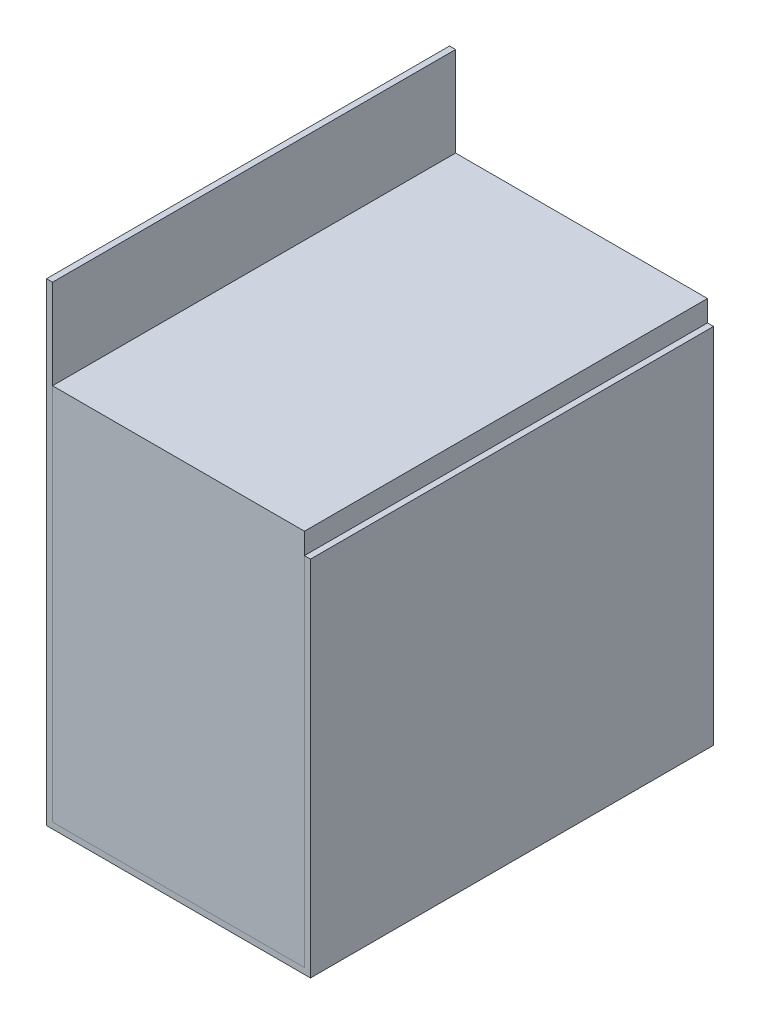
ISO-10303-21;
HEADER;
FILE_DESCRIPTION(('STEP AP214'),'2;1');
FILE_NAME('part.step','',(''),(''),'','','');
FILE_SCHEMA(('AUTOMOTIVE_DESIGN { 1 0 10303 214 1 1 1 1 }'));
ENDSEC;
DATA;
#1=APPLICATION_CONTEXT('core data for automotive mechanical design processes');
#2=APPLICATION_PROTOCOL_DEFINITION('international standard','automotive_design',2000,#1);
#3=PRODUCT_CONTEXT('',#1,'mechanical');
#4=PRODUCT('Part','Part','',(#3));
#5=PRODUCT_RELATED_PRODUCT_CATEGORY('part','',(#4));
#6=PRODUCT_DEFINITION_FORMATION('','',#4);
#7=PRODUCT_DEFINITION_CONTEXT('part definition',#1,'design');
#8=PRODUCT_DEFINITION('design','',#6,#7);
#9=PRODUCT_DEFINITION_SHAPE('','',#8);
#10=(LENGTH_UNIT() NAMED_UNIT(*) SI_UNIT(.MILLI.,.METRE.));
#11=(NAMED_UNIT(*) PLANE_ANGLE_UNIT() SI_UNIT($,.RADIAN.));
#12=(NAMED_UNIT(*) SI_UNIT($,.STERADIAN.) SOLID_ANGLE_UNIT());
#13=UNCERTAINTY_MEASURE_WITH_UNIT(LENGTH_MEASURE(1.E-05),#10,'distance_accuracy_value','');
#14=(GEOMETRIC_REPRESENTATION_CONTEXT(3) GLOBAL_UNCERTAINTY_ASSIGNED_CONTEXT((#13)) GLOBAL_UNIT_ASSIGNED_CONTEXT((#10,
#11,#12)) REPRESENTATION_CONTEXT('',''));
#15=CARTESIAN_POINT('',(0.,0.,0.));
#16=DIRECTION('',(0.,0.,1.));
#17=DIRECTION('',(1.,0.,0.));
#18=AXIS2_PLACEMENT_3D('',#15,#16,#17);
#19=CARTESIAN_POINT('',(6.00000000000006,-464.,200.));
#20=DIRECTION('',(1.,0.,0.));
#21=DIRECTION('',(0.,0.,-1.));
#22=AXIS2_PLACEMENT_3D('',#19,#20,#21);
#23=PLANE('',#22);
#24=DIRECTION('',(0.,-1.,0.));
#25=VECTOR('',#24,1.);
#26=CARTESIAN_POINT('',(6.00000000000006,-464.,-200.));
#27=LINE('',#26,#25);
#28=CARTESIAN_POINT('',(6.00000000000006,-89.,-200.));
#29=VERTEX_POINT('',#28);
#30=CARTESIAN_POINT('',(6.00000000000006,-464.,-200.));
#31=VERTEX_POINT('',#30);
#32=EDGE_CURVE('E105',#29,#31,#27,.T.);
#33=ORIENTED_EDGE('',*,*,#32,.T.);
#34=DIRECTION('',(0.,0.,-1.));
#35=VECTOR('',#34,1.);
#36=CARTESIAN_POINT('',(6.00000000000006,-464.,200.));
#37=LINE('',#36,#35);
#38=CARTESIAN_POINT('',(6.00000000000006,-464.,200.));
#39=VERTEX_POINT('',#38);
#40=EDGE_CURVE('E12',#39,#31,#37,.T.);
#41=ORIENTED_EDGE('',*,*,#40,.F.);
#42=DIRECTION('',(0.,-1.,0.));
#43=VECTOR('',#42,1.);
#44=CARTESIAN_POINT('',(6.00000000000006,-464.,200.));
#45=LINE('',#44,#43);
#46=CARTESIAN_POINT('',(6.00000000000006,-89.,200.));
#47=VERTEX_POINT('',#46);
#48=EDGE_CURVE('E93',#47,#39,#45,.T.);
#49=ORIENTED_EDGE('',*,*,#48,.F.);
#50=DIRECTION('',(0.,0.,-1.));
#51=VECTOR('',#50,1.);
#52=CARTESIAN_POINT('',(6.00000000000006,-89.,200.));
#53=LINE('',#52,#51);
#54=EDGE_CURVE('E101',#47,#29,#53,.T.);
#55=ORIENTED_EDGE('',*,*,#54,.T.);
#56=EDGE_LOOP('',(#33,#41,#49,#55));
#57=FACE_BOUND('',#56,.T.);
#58=ADVANCED_FACE('F42',(#57),#23,.F.);
#59=CARTESIAN_POINT('',(6.00000000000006,-464.,200.));
#60=DIRECTION('',(0.,1.,0.));
#61=DIRECTION('',(0.,0.,1.));
#62=AXIS2_PLACEMENT_3D('',#59,#60,#61);
#63=PLANE('',#62);
#64=DIRECTION('',(1.,0.,0.));
#65=VECTOR('',#64,1.);
#66=CARTESIAN_POINT('',(6.00000000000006,-464.,-200.));
#67=LINE('',#66,#65);
#68=CARTESIAN_POINT('',(256.,-464.,-200.));
#69=VERTEX_POINT('',#68);
#70=EDGE_CURVE('E97',#31,#69,#67,.T.);
#71=ORIENTED_EDGE('',*,*,#70,.T.);
#72=DIRECTION('',(0.,0.,-1.));
#73=VECTOR('',#72,1.);
#74=CARTESIAN_POINT('',(256.,-464.,200.));
#75=LINE('',#74,#73);
#76=CARTESIAN_POINT('',(256.,-464.,200.));
#77=VERTEX_POINT('',#76);
#78=EDGE_CURVE('E50',#77,#69,#75,.T.);
#79=ORIENTED_EDGE('',*,*,#78,.F.);
#80=DIRECTION('',(1.,0.,0.));
#81=VECTOR('',#80,1.);
#82=CARTESIAN_POINT('',(6.00000000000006,-464.,200.));
#83=LINE('',#82,#81);
#84=EDGE_CURVE('E88',#39,#77,#83,.T.);
#85=ORIENTED_EDGE('',*,*,#84,.F.);
#86=ORIENTED_EDGE('',*,*,#40,.T.);
#87=EDGE_LOOP('',(#71,#79,#85,#86));
#88=FACE_BOUND('',#87,.T.);
#89=ADVANCED_FACE('F96',(#88),#63,.F.);
#90=CARTESIAN_POINT('',(256.,-464.,200.));
#91=DIRECTION('',(-1.,0.,0.));
#92=DIRECTION('',(0.,0.,1.));
#93=AXIS2_PLACEMENT_3D('',#90,#91,#92);
#94=PLANE('',#93);
#95=DIRECTION('',(0.,1.,0.));
#96=VECTOR('',#95,1.);
#97=CARTESIAN_POINT('',(256.,-464.,-200.));
#98=LINE('',#97,#96);
#99=CARTESIAN_POINT('',(256.,-89.,-200.));
#100=VERTEX_POINT('',#99);
#101=EDGE_CURVE('E75',#69,#100,#98,.T.);
#102=ORIENTED_EDGE('',*,*,#101,.T.);
#103=DIRECTION('',(0.,0.,-1.));
#104=VECTOR('',#103,1.);
#105=CARTESIAN_POINT('',(256.,-89.,200.));
#106=LINE('',#105,#104);
#107=CARTESIAN_POINT('',(256.,-89.,200.));
#108=VERTEX_POINT('',#107);
#109=EDGE_CURVE('E98',#108,#100,#106,.T.);
#110=ORIENTED_EDGE('',*,*,#109,.F.);
#111=DIRECTION('',(0.,1.,0.));
#112=VECTOR('',#111,1.);
#113=CARTESIAN_POINT('',(256.,-464.,200.));
#114=LINE('',#113,#112);
#115=EDGE_CURVE('E91',#77,#108,#114,.T.);
#116=ORIENTED_EDGE('',*,*,#115,.F.);
#117=ORIENTED_EDGE('',*,*,#78,.T.);
#118=EDGE_LOOP('',(#102,#110,#116,#117));
#119=FACE_BOUND('',#118,.T.);
#120=ADVANCED_FACE('F99',(#119),#94,.F.);
#121=CARTESIAN_POINT('',(6.00000000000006,-89.,200.));
#122=DIRECTION('',(0.,-1.,0.));
#123=DIRECTION('',(0.,0.,-1.));
#124=AXIS2_PLACEMENT_3D('',#121,#122,#123);
#125=PLANE('',#124);
#126=DIRECTION('',(-1.,0.,0.));
#127=VECTOR('',#126,1.);
#128=CARTESIAN_POINT('',(6.00000000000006,-89.,-200.));
#129=LINE('',#128,#127);
#130=EDGE_CURVE('E81',#100,#29,#129,.T.);
#131=ORIENTED_EDGE('',*,*,#130,.T.);
#132=ORIENTED_EDGE('',*,*,#54,.F.);
#133=DIRECTION('',(-1.,0.,0.));
#134=VECTOR('',#133,1.);
#135=CARTESIAN_POINT('',(6.00000000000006,-89.,200.));
#136=LINE('',#135,#134);
#137=EDGE_CURVE('E58',#108,#47,#136,.T.);
#138=ORIENTED_EDGE('',*,*,#137,.F.);
#139=ORIENTED_EDGE('',*,*,#109,.T.);
#140=EDGE_LOOP('',(#131,#132,#138,#139));
#141=FACE_BOUND('',#140,.T.);
#142=ADVANCED_FACE('F112',(#141),#125,.F.);
#143=CARTESIAN_POINT('',(0.,0.,200.));
#144=DIRECTION('',(0.,0.,-1.));
#145=DIRECTION('',(-1.,0.,0.));
#146=AXIS2_PLACEMENT_3D('',#143,#144,#145);
#147=PLANE('',#146);
#148=ORIENTED_EDGE('',*,*,#48,.T.);
#149=ORIENTED_EDGE('',*,*,#84,.T.);
#150=ORIENTED_EDGE('',*,*,#115,.T.);
#151=ORIENTED_EDGE('',*,*,#137,.T.);
#152=EDGE_LOOP('',(#148,#149,#150,#151));
#153=FACE_BOUND('',#152,.T.);
#154=ADVANCED_FACE('F89',(#153),#147,.F.);
#155=CARTESIAN_POINT('',(0.,0.,-200.));
#156=DIRECTION('',(0.,0.,-1.));
#157=DIRECTION('',(-1.,0.,0.));
#158=AXIS2_PLACEMENT_3D('',#155,#156,#157);
#159=PLANE('',#158);
#160=ORIENTED_EDGE('',*,*,#32,.F.);
#161=ORIENTED_EDGE('',*,*,#130,.F.);
#162=ORIENTED_EDGE('',*,*,#101,.F.);
#163=ORIENTED_EDGE('',*,*,#70,.F.);
#164=EDGE_LOOP('',(#160,#161,#162,#163));
#165=FACE_BOUND('',#164,.T.);
#166=ADVANCED_FACE('F115',(#165),#159,.T.);
#167=CLOSED_SHELL('',(#58,#89,#120,#142,#154,#166));
#168=MANIFOLD_SOLID_BREP('B2',#167);
#169=CARTESIAN_POINT('',(0.,0.,200.));
#170=DIRECTION('',(1.,0.,0.));
#171=DIRECTION('',(0.,1.,0.));
#172=AXIS2_PLACEMENT_3D('',#169,#170,#171);
#173=PLANE('',#172);
#174=DIRECTION('',(0.,-1.,0.));
#175=VECTOR('',#174,1.);
#176=CARTESIAN_POINT('',(0.,0.,-200.));
#177=LINE('',#176,#175);
#178=CARTESIAN_POINT('',(0.,0.,-200.));
#179=VERTEX_POINT('',#178);
#180=CARTESIAN_POINT('',(0.,-470.,-200.));
#181=VERTEX_POINT('',#180);
#182=EDGE_CURVE('E261',#179,#181,#177,.T.);
#183=ORIENTED_EDGE('',*,*,#182,.T.);
#184=DIRECTION('',(0.,0.,-1.));
#185=VECTOR('',#184,1.);
#186=CARTESIAN_POINT('',(0.,-470.,200.));
#187=LINE('',#186,#185);
#188=CARTESIAN_POINT('',(0.,-470.,200.));
#189=VERTEX_POINT('',#188);
#190=EDGE_CURVE('E40',#189,#181,#187,.T.);
#191=ORIENTED_EDGE('',*,*,#190,.F.);
#192=DIRECTION('',(0.,-1.,0.));
#193=VECTOR('',#192,1.);
#194=CARTESIAN_POINT('',(0.,0.,200.));
#195=LINE('',#194,#193);
#196=CARTESIAN_POINT('',(0.,0.,200.));
#197=VERTEX_POINT('',#196);
#198=EDGE_CURVE('E275',#197,#189,#195,.T.);
#199=ORIENTED_EDGE('',*,*,#198,.F.);
#200=DIRECTION('',(0.,0.,-1.));
#201=VECTOR('',#200,1.);
#202=CARTESIAN_POINT('',(0.,0.,200.));
#203=LINE('',#202,#201);
#204=EDGE_CURVE('E257',#197,#179,#203,.T.);
#205=ORIENTED_EDGE('',*,*,#204,.T.);
#206=EDGE_LOOP('',(#183,#191,#199,#205));
#207=FACE_BOUND('',#206,.T.);
#208=ADVANCED_FACE('F165',(#207),#173,.F.);
#209=CARTESIAN_POINT('',(0.,-470.,200.));
#210=DIRECTION('',(0.,1.,0.));
#211=DIRECTION('',(0.,0.,1.));
#212=AXIS2_PLACEMENT_3D('',#209,#210,#211);
#213=PLANE('',#212);
#214=DIRECTION('',(1.,0.,0.));
#215=VECTOR('',#214,1.);
#216=CARTESIAN_POINT('',(0.,-470.,-200.));
#217=LINE('',#216,#215);
#218=CARTESIAN_POINT('',(262.,-470.,-200.));
#219=VERTEX_POINT('',#218);
#220=EDGE_CURVE('E264',#181,#219,#217,.T.);
#221=ORIENTED_EDGE('',*,*,#220,.T.);
#222=DIRECTION('',(0.,0.,-1.));
#223=VECTOR('',#222,1.);
#224=CARTESIAN_POINT('',(262.,-470.,200.));
#225=LINE('',#224,#223);
#226=CARTESIAN_POINT('',(262.,-470.,200.));
#227=VERTEX_POINT('',#226);
#228=EDGE_CURVE('E173',#227,#219,#225,.T.);
#229=ORIENTED_EDGE('',*,*,#228,.F.);
#230=DIRECTION('',(1.,0.,0.));
#231=VECTOR('',#230,1.);
#232=CARTESIAN_POINT('',(0.,-470.,200.));
#233=LINE('',#232,#231);
#234=EDGE_CURVE('E224',#189,#227,#233,.T.);
#235=ORIENTED_EDGE('',*,*,#234,.F.);
#236=ORIENTED_EDGE('',*,*,#190,.T.);
#237=EDGE_LOOP('',(#221,#229,#235,#236));
#238=FACE_BOUND('',#237,.T.);
#239=ADVANCED_FACE('F310',(#238),#213,.F.);
#240=CARTESIAN_POINT('',(262.,-470.,200.));
#241=DIRECTION('',(-1.,0.,0.));
#242=DIRECTION('',(0.,0.,1.));
#243=AXIS2_PLACEMENT_3D('',#240,#241,#242);
#244=PLANE('',#243);
#245=DIRECTION('',(0.,1.,0.));
#246=VECTOR('',#245,1.);
#247=CARTESIAN_POINT('',(262.,-470.,-200.));
#248=LINE('',#247,#246);
#249=CARTESIAN_POINT('',(262.,-110.,-200.));
#250=VERTEX_POINT('',#249);
#251=EDGE_CURVE('E266',#219,#250,#248,.T.);
#252=ORIENTED_EDGE('',*,*,#251,.T.);
#253=DIRECTION('',(0.,0.,-1.));
#254=VECTOR('',#253,1.);
#255=CARTESIAN_POINT('',(262.,-110.,200.));
#256=LINE('',#255,#254);
#257=CARTESIAN_POINT('',(262.,-110.,200.));
#258=VERTEX_POINT('',#257);
#259=EDGE_CURVE('E282',#258,#250,#256,.T.);
#260=ORIENTED_EDGE('',*,*,#259,.F.);
#261=DIRECTION('',(0.,1.,0.));
#262=VECTOR('',#261,1.);
#263=CARTESIAN_POINT('',(262.,-470.,200.));
#264=LINE('',#263,#262);
#265=EDGE_CURVE('E290',#227,#258,#264,.T.);
#266=ORIENTED_EDGE('',*,*,#265,.F.);
#267=ORIENTED_EDGE('',*,*,#228,.T.);
#268=EDGE_LOOP('',(#252,#260,#266,#267));
#269=FACE_BOUND('',#268,.T.);
#270=ADVANCED_FACE('F288',(#269),#244,.F.);
#271=CARTESIAN_POINT('',(262.,-110.,200.));
#272=DIRECTION('',(0.,-1.,0.));
#273=DIRECTION('',(0.,0.,-1.));
#274=AXIS2_PLACEMENT_3D('',#271,#272,#273);
#275=PLANE('',#274);
#276=DIRECTION('',(-1.,0.,0.));
#277=VECTOR('',#276,1.);
#278=CARTESIAN_POINT('',(262.,-110.,-200.));
#279=LINE('',#278,#277);
#280=CARTESIAN_POINT('',(256.,-110.,-200.));
#281=VERTEX_POINT('',#280);
#282=EDGE_CURVE('E268',#250,#281,#279,.T.);
#283=ORIENTED_EDGE('',*,*,#282,.T.);
#284=DIRECTION('',(0.,0.,-1.));
#285=VECTOR('',#284,1.);
#286=CARTESIAN_POINT('',(256.,-110.,200.));
#287=LINE('',#286,#285);
#288=CARTESIAN_POINT('',(256.,-110.,200.));
#289=VERTEX_POINT('',#288);
#290=EDGE_CURVE('E279',#289,#281,#287,.T.);
#291=ORIENTED_EDGE('',*,*,#290,.F.);
#292=DIRECTION('',(-1.,0.,0.));
#293=VECTOR('',#292,1.);
#294=CARTESIAN_POINT('',(262.,-110.,200.));
#295=LINE('',#294,#293);
#296=EDGE_CURVE('E302',#258,#289,#295,.T.);
#297=ORIENTED_EDGE('',*,*,#296,.F.);
#298=ORIENTED_EDGE('',*,*,#259,.T.);
#299=EDGE_LOOP('',(#283,#291,#297,#298));
#300=FACE_BOUND('',#299,.T.);
#301=ADVANCED_FACE('F298',(#300),#275,.F.);
#302=CARTESIAN_POINT('',(256.,-110.,200.));
#303=DIRECTION('',(1.,0.,0.));
#304=DIRECTION('',(0.,1.,0.));
#305=AXIS2_PLACEMENT_3D('',#302,#303,#304);
#306=PLANE('',#305);
#307=DIRECTION('',(0.,-1.,0.));
#308=VECTOR('',#307,1.);
#309=CARTESIAN_POINT('',(256.,-110.,-200.));
#310=LINE('',#309,#308);
#311=CARTESIAN_POINT('',(256.,-464.,-200.));
#312=VERTEX_POINT('',#311);
#313=EDGE_CURVE('E270',#281,#312,#310,.T.);
#314=ORIENTED_EDGE('',*,*,#313,.T.);
#315=DIRECTION('',(0.,0.,-1.));
#316=VECTOR('',#315,1.);
#317=CARTESIAN_POINT('',(256.,-464.,200.));
#318=LINE('',#317,#316);
#319=CARTESIAN_POINT('',(256.,-464.,200.));
#320=VERTEX_POINT('',#319);
#321=EDGE_CURVE('E252',#320,#312,#318,.T.);
#322=ORIENTED_EDGE('',*,*,#321,.F.);
#323=DIRECTION('',(0.,-1.,0.));
#324=VECTOR('',#323,1.);
#325=CARTESIAN_POINT('',(256.,-110.,200.));
#326=LINE('',#325,#324);
#327=EDGE_CURVE('E243',#289,#320,#326,.T.);
#328=ORIENTED_EDGE('',*,*,#327,.F.);
#329=ORIENTED_EDGE('',*,*,#290,.T.);
#330=EDGE_LOOP('',(#314,#322,#328,#329));
#331=FACE_BOUND('',#330,.T.);
#332=ADVANCED_FACE('F301',(#331),#306,.F.);
#333=CARTESIAN_POINT('',(256.,-464.,200.));
#334=DIRECTION('',(0.,-1.,0.));
#335=DIRECTION('',(1.,0.,0.));
#336=AXIS2_PLACEMENT_3D('',#333,#334,#335);
#337=PLANE('',#336);
#338=DIRECTION('',(-1.,0.,0.));
#339=VECTOR('',#338,1.);
#340=CARTESIAN_POINT('',(256.,-464.,-200.));
#341=LINE('',#340,#339);
#342=CARTESIAN_POINT('',(6.00000000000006,-464.,-200.));
#343=VERTEX_POINT('',#342);
#344=EDGE_CURVE('E251',#312,#343,#341,.T.);
#345=ORIENTED_EDGE('',*,*,#344,.T.);
#346=DIRECTION('',(0.,0.,-1.));
#347=VECTOR('',#346,1.);
#348=CARTESIAN_POINT('',(6.00000000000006,-464.,200.));
#349=LINE('',#348,#347);
#350=CARTESIAN_POINT('',(6.00000000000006,-464.,200.));
#351=VERTEX_POINT('',#350);
#352=EDGE_CURVE('E248',#351,#343,#349,.T.);
#353=ORIENTED_EDGE('',*,*,#352,.F.);
#354=DIRECTION('',(-1.,0.,0.));
#355=VECTOR('',#354,1.);
#356=CARTESIAN_POINT('',(256.,-464.,200.));
#357=LINE('',#356,#355);
#358=EDGE_CURVE('E237',#320,#351,#357,.T.);
#359=ORIENTED_EDGE('',*,*,#358,.F.);
#360=ORIENTED_EDGE('',*,*,#321,.T.);
#361=EDGE_LOOP('',(#345,#353,#359,#360));
#362=FACE_BOUND('',#361,.T.);
#363=ADVANCED_FACE('F249',(#362),#337,.F.);
#364=CARTESIAN_POINT('',(6.,0.,200.));
#365=DIRECTION('',(-1.,0.,0.));
#366=DIRECTION('',(0.,-1.,0.));
#367=AXIS2_PLACEMENT_3D('',#364,#365,#366);
#368=PLANE('',#367);
#369=DIRECTION('',(0.,1.,0.));
#370=VECTOR('',#369,1.);
#371=CARTESIAN_POINT('',(6.,0.,-200.));
#372=LINE('',#371,#370);
#373=CARTESIAN_POINT('',(6.,0.,-200.));
#374=VERTEX_POINT('',#373);
#375=EDGE_CURVE('E210',#343,#374,#372,.T.);
#376=ORIENTED_EDGE('',*,*,#375,.T.);
#377=DIRECTION('',(0.,0.,-1.));
#378=VECTOR('',#377,1.);
#379=CARTESIAN_POINT('',(6.,0.,200.));
#380=LINE('',#379,#378);
#381=CARTESIAN_POINT('',(6.,0.,200.));
#382=VERTEX_POINT('',#381);
#383=EDGE_CURVE('E253',#382,#374,#380,.T.);
#384=ORIENTED_EDGE('',*,*,#383,.F.);
#385=DIRECTION('',(0.,1.,0.));
#386=VECTOR('',#385,1.);
#387=CARTESIAN_POINT('',(6.,0.,200.));
#388=LINE('',#387,#386);
#389=EDGE_CURVE('E241',#351,#382,#388,.T.);
#390=ORIENTED_EDGE('',*,*,#389,.F.);
#391=ORIENTED_EDGE('',*,*,#352,.T.);
#392=EDGE_LOOP('',(#376,#384,#390,#391));
#393=FACE_BOUND('',#392,.T.);
#394=ADVANCED_FACE('F255',(#393),#368,.F.);
#395=CARTESIAN_POINT('',(0.,0.,200.));
#396=DIRECTION('',(0.,-1.,0.));
#397=DIRECTION('',(0.,0.,-1.));
#398=AXIS2_PLACEMENT_3D('',#395,#396,#397);
#399=PLANE('',#398);
#400=DIRECTION('',(-1.,0.,0.));
#401=VECTOR('',#400,1.);
#402=CARTESIAN_POINT('',(0.,0.,-200.));
#403=LINE('',#402,#401);
#404=EDGE_CURVE('E216',#374,#179,#403,.T.);
#405=ORIENTED_EDGE('',*,*,#404,.T.);
#406=ORIENTED_EDGE('',*,*,#204,.F.);
#407=DIRECTION('',(-1.,0.,0.));
#408=VECTOR('',#407,1.);
#409=CARTESIAN_POINT('',(0.,0.,200.));
#410=LINE('',#409,#408);
#411=EDGE_CURVE('E181',#382,#197,#410,.T.);
#412=ORIENTED_EDGE('',*,*,#411,.F.);
#413=ORIENTED_EDGE('',*,*,#383,.T.);
#414=EDGE_LOOP('',(#405,#406,#412,#413));
#415=FACE_BOUND('',#414,.T.);
#416=ADVANCED_FACE('F326',(#415),#399,.F.);
#417=CARTESIAN_POINT('',(0.,0.,200.));
#418=DIRECTION('',(0.,0.,1.));
#419=DIRECTION('',(1.,0.,0.));
#420=AXIS2_PLACEMENT_3D('',#417,#418,#419);
#421=PLANE('',#420);
#422=ORIENTED_EDGE('',*,*,#198,.T.);
#423=ORIENTED_EDGE('',*,*,#234,.T.);
#424=ORIENTED_EDGE('',*,*,#265,.T.);
#425=ORIENTED_EDGE('',*,*,#296,.T.);
#426=ORIENTED_EDGE('',*,*,#327,.T.);
#427=ORIENTED_EDGE('',*,*,#358,.T.);
#428=ORIENTED_EDGE('',*,*,#389,.T.);
#429=ORIENTED_EDGE('',*,*,#411,.T.);
#430=EDGE_LOOP('',(#422,#423,#424,#425,#426,#427,#428,#429));
#431=FACE_BOUND('',#430,.T.);
#432=ADVANCED_FACE('F239',(#431),#421,.T.);
#433=CARTESIAN_POINT('',(0.,0.,-200.));
#434=DIRECTION('',(0.,0.,1.));
#435=DIRECTION('',(1.,0.,0.));
#436=AXIS2_PLACEMENT_3D('',#433,#434,#435);
#437=PLANE('',#436);
#438=ORIENTED_EDGE('',*,*,#182,.F.);
#439=ORIENTED_EDGE('',*,*,#404,.F.);
#440=ORIENTED_EDGE('',*,*,#375,.F.);
#441=ORIENTED_EDGE('',*,*,#344,.F.);
#442=ORIENTED_EDGE('',*,*,#313,.F.);
#443=ORIENTED_EDGE('',*,*,#282,.F.);
#444=ORIENTED_EDGE('',*,*,#251,.F.);
#445=ORIENTED_EDGE('',*,*,#220,.F.);
#446=EDGE_LOOP('',(#438,#439,#440,#441,#442,#443,#444,#445));
#447=FACE_BOUND('',#446,.T.);
#448=ADVANCED_FACE('F294',(#447),#437,.F.);
#449=CLOSED_SHELL('',(#208,#239,#270,#301,#332,#363,#394,#416,#432,#448));
#450=MANIFOLD_SOLID_BREP('B6',#449);
#451=ADVANCED_BREP_SHAPE_REPRESENTATION('',(#18,#168,#450),#14);
#452=SHAPE_DEFINITION_REPRESENTATION(#9,#451);
ENDSEC;
END-ISO-10303-21;
